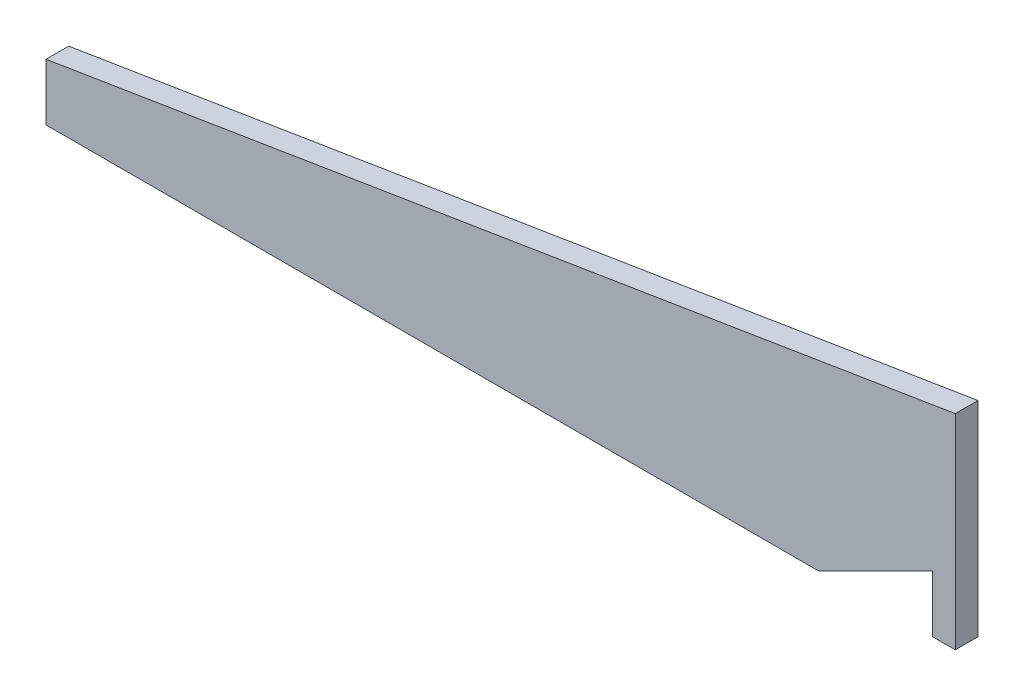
ISO-10303-21;
HEADER;
FILE_DESCRIPTION(('STEP AP214'),'2;1');
FILE_NAME('part.step','',(''),(''),'','','');
FILE_SCHEMA(('AUTOMOTIVE_DESIGN { 1 0 10303 214 1 1 1 1 }'));
ENDSEC;
DATA;
#1=APPLICATION_CONTEXT('core data for automotive mechanical design processes');
#2=APPLICATION_PROTOCOL_DEFINITION('international standard','automotive_design',2000,#1);
#3=PRODUCT_CONTEXT('',#1,'mechanical');
#4=PRODUCT('Part','Part','',(#3));
#5=PRODUCT_RELATED_PRODUCT_CATEGORY('part','',(#4));
#6=PRODUCT_DEFINITION_FORMATION('','',#4);
#7=PRODUCT_DEFINITION_CONTEXT('part definition',#1,'design');
#8=PRODUCT_DEFINITION('design','',#6,#7);
#9=PRODUCT_DEFINITION_SHAPE('','',#8);
#10=(LENGTH_UNIT() NAMED_UNIT(*) SI_UNIT(.MILLI.,.METRE.));
#11=(NAMED_UNIT(*) PLANE_ANGLE_UNIT() SI_UNIT($,.RADIAN.));
#12=(NAMED_UNIT(*) SI_UNIT($,.STERADIAN.) SOLID_ANGLE_UNIT());
#13=UNCERTAINTY_MEASURE_WITH_UNIT(LENGTH_MEASURE(1.E-05),#10,'distance_accuracy_value','');
#14=(GEOMETRIC_REPRESENTATION_CONTEXT(3) GLOBAL_UNCERTAINTY_ASSIGNED_CONTEXT((#13)) GLOBAL_UNIT_ASSIGNED_CONTEXT((#10,
#11,#12)) REPRESENTATION_CONTEXT('',''));
#15=CARTESIAN_POINT('',(0.,0.,0.));
#16=DIRECTION('',(0.,0.,1.));
#17=DIRECTION('',(1.,0.,0.));
#18=AXIS2_PLACEMENT_3D('',#15,#16,#17);
#19=CARTESIAN_POINT('',(7.29789674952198,-14.595793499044,2.));
#20=DIRECTION('',(-0.447213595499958,0.894427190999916,0.));
#21=DIRECTION('',(-0.894427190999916,-0.447213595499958,0.));
#22=AXIS2_PLACEMENT_3D('',#19,#20,#21);
#23=PLANE('',#22);
#24=DIRECTION('',(0.894427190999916,0.447213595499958,0.));
#25=VECTOR('',#24,1.);
#26=CARTESIAN_POINT('',(7.29789674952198,-14.595793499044,0.));
#27=LINE('',#26,#25);
#28=CARTESIAN_POINT('',(36.4894837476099,0.,0.));
#29=VERTEX_POINT('',#28);
#30=CARTESIAN_POINT('',(46.4894837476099,5.,0.));
#31=VERTEX_POINT('',#30);
#32=EDGE_CURVE('E135',#29,#31,#27,.T.);
#33=ORIENTED_EDGE('',*,*,#32,.T.);
#34=DIRECTION('',(0.,0.,-1.));
#35=VECTOR('',#34,1.);
#36=CARTESIAN_POINT('',(46.4894837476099,5.,2.));
#37=LINE('',#36,#35);
#38=CARTESIAN_POINT('',(46.4894837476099,5.,2.));
#39=VERTEX_POINT('',#38);
#40=EDGE_CURVE('E11',#39,#31,#37,.T.);
#41=ORIENTED_EDGE('',*,*,#40,.F.);
#42=DIRECTION('',(0.894427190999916,0.447213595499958,0.));
#43=VECTOR('',#42,1.);
#44=CARTESIAN_POINT('',(7.29789674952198,-14.595793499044,2.));
#45=LINE('',#44,#43);
#46=CARTESIAN_POINT('',(36.4894837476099,0.,2.));
#47=VERTEX_POINT('',#46);
#48=EDGE_CURVE('E181',#47,#39,#45,.T.);
#49=ORIENTED_EDGE('',*,*,#48,.F.);
#50=DIRECTION('',(0.,0.,-1.));
#51=VECTOR('',#50,1.);
#52=CARTESIAN_POINT('',(36.4894837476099,0.,2.));
#53=LINE('',#52,#51);
#54=EDGE_CURVE('E130',#47,#29,#53,.T.);
#55=ORIENTED_EDGE('',*,*,#54,.T.);
#56=EDGE_LOOP('',(#33,#41,#49,#55));
#57=FACE_BOUND('',#56,.T.);
#58=ADVANCED_FACE('F41',(#57),#23,.F.);
#59=CARTESIAN_POINT('',(46.4894837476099,0.,2.));
#60=DIRECTION('',(1.,0.,0.));
#61=DIRECTION('',(0.,1.,0.));
#62=AXIS2_PLACEMENT_3D('',#59,#60,#61);
#63=PLANE('',#62);
#64=DIRECTION('',(0.,-1.,0.));
#65=VECTOR('',#64,1.);
#66=CARTESIAN_POINT('',(46.4894837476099,0.,0.));
#67=LINE('',#66,#65);
#68=CARTESIAN_POINT('',(46.4894837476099,0.,0.));
#69=VERTEX_POINT('',#68);
#70=EDGE_CURVE('E139',#31,#69,#67,.T.);
#71=ORIENTED_EDGE('',*,*,#70,.T.);
#72=DIRECTION('',(0.,0.,-1.));
#73=VECTOR('',#72,1.);
#74=CARTESIAN_POINT('',(46.4894837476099,0.,2.));
#75=LINE('',#74,#73);
#76=CARTESIAN_POINT('',(46.4894837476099,0.,2.));
#77=VERTEX_POINT('',#76);
#78=EDGE_CURVE('E50',#77,#69,#75,.T.);
#79=ORIENTED_EDGE('',*,*,#78,.F.);
#80=DIRECTION('',(0.,-1.,0.));
#81=VECTOR('',#80,1.);
#82=CARTESIAN_POINT('',(46.4894837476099,0.,2.));
#83=LINE('',#82,#81);
#84=EDGE_CURVE('E94',#39,#77,#83,.T.);
#85=ORIENTED_EDGE('',*,*,#84,.F.);
#86=ORIENTED_EDGE('',*,*,#40,.T.);
#87=EDGE_LOOP('',(#71,#79,#85,#86));
#88=FACE_BOUND('',#87,.T.);
#89=ADVANCED_FACE('F187',(#88),#63,.F.);
#90=CARTESIAN_POINT('',(0.,0.,2.));
#91=DIRECTION('',(0.,1.,0.));
#92=DIRECTION('',(0.,0.,1.));
#93=AXIS2_PLACEMENT_3D('',#90,#91,#92);
#94=PLANE('',#93);
#95=DIRECTION('',(1.,0.,0.));
#96=VECTOR('',#95,1.);
#97=CARTESIAN_POINT('',(0.,0.,0.));
#98=LINE('',#97,#96);
#99=CARTESIAN_POINT('',(48.48948374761,0.,0.));
#100=VERTEX_POINT('',#99);
#101=EDGE_CURVE('E142',#69,#100,#98,.T.);
#102=ORIENTED_EDGE('',*,*,#101,.T.);
#103=DIRECTION('',(0.,0.,-1.));
#104=VECTOR('',#103,1.);
#105=CARTESIAN_POINT('',(48.48948374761,0.,2.));
#106=LINE('',#105,#104);
#107=CARTESIAN_POINT('',(48.48948374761,0.,2.));
#108=VERTEX_POINT('',#107);
#109=EDGE_CURVE('E161',#108,#100,#106,.T.);
#110=ORIENTED_EDGE('',*,*,#109,.F.);
#111=DIRECTION('',(1.,0.,0.));
#112=VECTOR('',#111,1.);
#113=CARTESIAN_POINT('',(0.,0.,2.));
#114=LINE('',#113,#112);
#115=EDGE_CURVE('E132',#77,#108,#114,.T.);
#116=ORIENTED_EDGE('',*,*,#115,.F.);
#117=ORIENTED_EDGE('',*,*,#78,.T.);
#118=EDGE_LOOP('',(#102,#110,#116,#117));
#119=FACE_BOUND('',#118,.T.);
#120=ADVANCED_FACE('F168',(#119),#94,.F.);
#121=CARTESIAN_POINT('',(48.48948374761,0.,2.));
#122=DIRECTION('',(1.,0.,0.));
#123=DIRECTION('',(0.,1.,0.));
#124=AXIS2_PLACEMENT_3D('',#121,#122,#123);
#125=PLANE('',#124);
#126=DIRECTION('',(0.,-1.,0.));
#127=VECTOR('',#126,1.);
#128=CARTESIAN_POINT('',(48.48948374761,0.,0.));
#129=LINE('',#128,#127);
#130=CARTESIAN_POINT('',(48.4894837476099,18.,0.));
#131=VERTEX_POINT('',#130);
#132=EDGE_CURVE('E146',#131,#100,#129,.T.);
#133=ORIENTED_EDGE('',*,*,#132,.F.);
#134=DIRECTION('',(0.,0.,-1.));
#135=VECTOR('',#134,1.);
#136=CARTESIAN_POINT('',(48.4894837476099,18.,2.));
#137=LINE('',#136,#135);
#138=CARTESIAN_POINT('',(48.4894837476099,18.,2.));
#139=VERTEX_POINT('',#138);
#140=EDGE_CURVE('E117',#139,#131,#137,.T.);
#141=ORIENTED_EDGE('',*,*,#140,.F.);
#142=DIRECTION('',(0.,-1.,0.));
#143=VECTOR('',#142,1.);
#144=CARTESIAN_POINT('',(48.48948374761,0.,2.));
#145=LINE('',#144,#143);
#146=EDGE_CURVE('E123',#139,#108,#145,.T.);
#147=ORIENTED_EDGE('',*,*,#146,.T.);
#148=ORIENTED_EDGE('',*,*,#109,.T.);
#149=EDGE_LOOP('',(#133,#141,#147,#148));
#150=FACE_BOUND('',#149,.T.);
#151=ADVANCED_FACE('F175',(#150),#125,.T.);
#152=CARTESIAN_POINT('',(-1.60226476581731,9.86009086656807,2.));
#153=DIRECTION('',(-0.160396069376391,0.987052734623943,0.));
#154=DIRECTION('',(-0.987052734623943,-0.160396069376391,0.));
#155=AXIS2_PLACEMENT_3D('',#152,#153,#154);
#156=PLANE('',#155);
#157=DIRECTION('',(0.987052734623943,0.160396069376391,0.));
#158=VECTOR('',#157,1.);
#159=CARTESIAN_POINT('',(-1.60226476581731,9.86009086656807,0.));
#160=LINE('',#159,#158);
#161=CARTESIAN_POINT('',(-31.5105162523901,5.,0.));
#162=VERTEX_POINT('',#161);
#163=EDGE_CURVE('E111',#162,#131,#160,.T.);
#164=ORIENTED_EDGE('',*,*,#163,.F.);
#165=DIRECTION('',(0.,0.,-1.));
#166=VECTOR('',#165,1.);
#167=CARTESIAN_POINT('',(-31.5105162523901,5.,2.));
#168=LINE('',#167,#166);
#169=CARTESIAN_POINT('',(-31.5105162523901,5.,2.));
#170=VERTEX_POINT('',#169);
#171=EDGE_CURVE('E106',#170,#162,#168,.T.);
#172=ORIENTED_EDGE('',*,*,#171,.F.);
#173=DIRECTION('',(0.987052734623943,0.160396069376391,0.));
#174=VECTOR('',#173,1.);
#175=CARTESIAN_POINT('',(-1.60226476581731,9.86009086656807,2.));
#176=LINE('',#175,#174);
#177=EDGE_CURVE('E109',#170,#139,#176,.T.);
#178=ORIENTED_EDGE('',*,*,#177,.T.);
#179=ORIENTED_EDGE('',*,*,#140,.T.);
#180=EDGE_LOOP('',(#164,#172,#178,#179));
#181=FACE_BOUND('',#180,.T.);
#182=ADVANCED_FACE('F108',(#181),#156,.T.);
#183=CARTESIAN_POINT('',(-31.5105162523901,0.,2.));
#184=DIRECTION('',(-1.,0.,0.));
#185=DIRECTION('',(0.,0.,1.));
#186=AXIS2_PLACEMENT_3D('',#183,#184,#185);
#187=PLANE('',#186);
#188=DIRECTION('',(0.,1.,0.));
#189=VECTOR('',#188,1.);
#190=CARTESIAN_POINT('',(-31.5105162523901,0.,0.));
#191=LINE('',#190,#189);
#192=CARTESIAN_POINT('',(-31.5105162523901,0.,0.));
#193=VERTEX_POINT('',#192);
#194=EDGE_CURVE('E152',#193,#162,#191,.T.);
#195=ORIENTED_EDGE('',*,*,#194,.F.);
#196=DIRECTION('',(0.,0.,-1.));
#197=VECTOR('',#196,1.);
#198=CARTESIAN_POINT('',(-31.5105162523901,0.,2.));
#199=LINE('',#198,#197);
#200=CARTESIAN_POINT('',(-31.5105162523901,0.,2.));
#201=VERTEX_POINT('',#200);
#202=EDGE_CURVE('E83',#201,#193,#199,.T.);
#203=ORIENTED_EDGE('',*,*,#202,.F.);
#204=DIRECTION('',(0.,1.,0.));
#205=VECTOR('',#204,1.);
#206=CARTESIAN_POINT('',(-31.5105162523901,0.,2.));
#207=LINE('',#206,#205);
#208=EDGE_CURVE('E121',#201,#170,#207,.T.);
#209=ORIENTED_EDGE('',*,*,#208,.T.);
#210=ORIENTED_EDGE('',*,*,#171,.T.);
#211=EDGE_LOOP('',(#195,#203,#209,#210));
#212=FACE_BOUND('',#211,.T.);
#213=ADVANCED_FACE('F126',(#212),#187,.T.);
#214=EDGE_CURVE('E86',#193,#29,#98,.T.);
#215=ORIENTED_EDGE('',*,*,#214,.T.);
#216=ORIENTED_EDGE('',*,*,#54,.F.);
#217=EDGE_CURVE('E58',#201,#47,#114,.T.);
#218=ORIENTED_EDGE('',*,*,#217,.F.);
#219=ORIENTED_EDGE('',*,*,#202,.T.);
#220=EDGE_LOOP('',(#215,#216,#218,#219));
#221=FACE_BOUND('',#220,.T.);
#222=ADVANCED_FACE('F194',(#221),#94,.F.);
#223=CARTESIAN_POINT('',(0.,0.,2.));
#224=DIRECTION('',(0.,0.,1.));
#225=DIRECTION('',(1.,0.,0.));
#226=AXIS2_PLACEMENT_3D('',#223,#224,#225);
#227=PLANE('',#226);
#228=ORIENTED_EDGE('',*,*,#48,.T.);
#229=ORIENTED_EDGE('',*,*,#84,.T.);
#230=ORIENTED_EDGE('',*,*,#115,.T.);
#231=ORIENTED_EDGE('',*,*,#146,.F.);
#232=ORIENTED_EDGE('',*,*,#177,.F.);
#233=ORIENTED_EDGE('',*,*,#208,.F.);
#234=ORIENTED_EDGE('',*,*,#217,.T.);
#235=EDGE_LOOP('',(#228,#229,#230,#231,#232,#233,#234));
#236=FACE_BOUND('',#235,.T.);
#237=ADVANCED_FACE('F120',(#236),#227,.T.);
#238=CARTESIAN_POINT('',(0.,0.,0.));
#239=DIRECTION('',(0.,0.,1.));
#240=DIRECTION('',(1.,0.,0.));
#241=AXIS2_PLACEMENT_3D('',#238,#239,#240);
#242=PLANE('',#241);
#243=ORIENTED_EDGE('',*,*,#32,.F.);
#244=ORIENTED_EDGE('',*,*,#214,.F.);
#245=ORIENTED_EDGE('',*,*,#194,.T.);
#246=ORIENTED_EDGE('',*,*,#163,.T.);
#247=ORIENTED_EDGE('',*,*,#132,.T.);
#248=ORIENTED_EDGE('',*,*,#101,.F.);
#249=ORIENTED_EDGE('',*,*,#70,.F.);
#250=EDGE_LOOP('',(#243,#244,#245,#246,#247,#248,#249));
#251=FACE_BOUND('',#250,.T.);
#252=ADVANCED_FACE('F172',(#251),#242,.F.);
#253=CLOSED_SHELL('',(#58,#89,#120,#151,#182,#213,#222,#237,#252));
#254=MANIFOLD_SOLID_BREP('B2',#253);
#255=ADVANCED_BREP_SHAPE_REPRESENTATION('',(#18,#254),#14);
#256=SHAPE_DEFINITION_REPRESENTATION(#9,#255);
ENDSEC;
END-ISO-10303-21;
